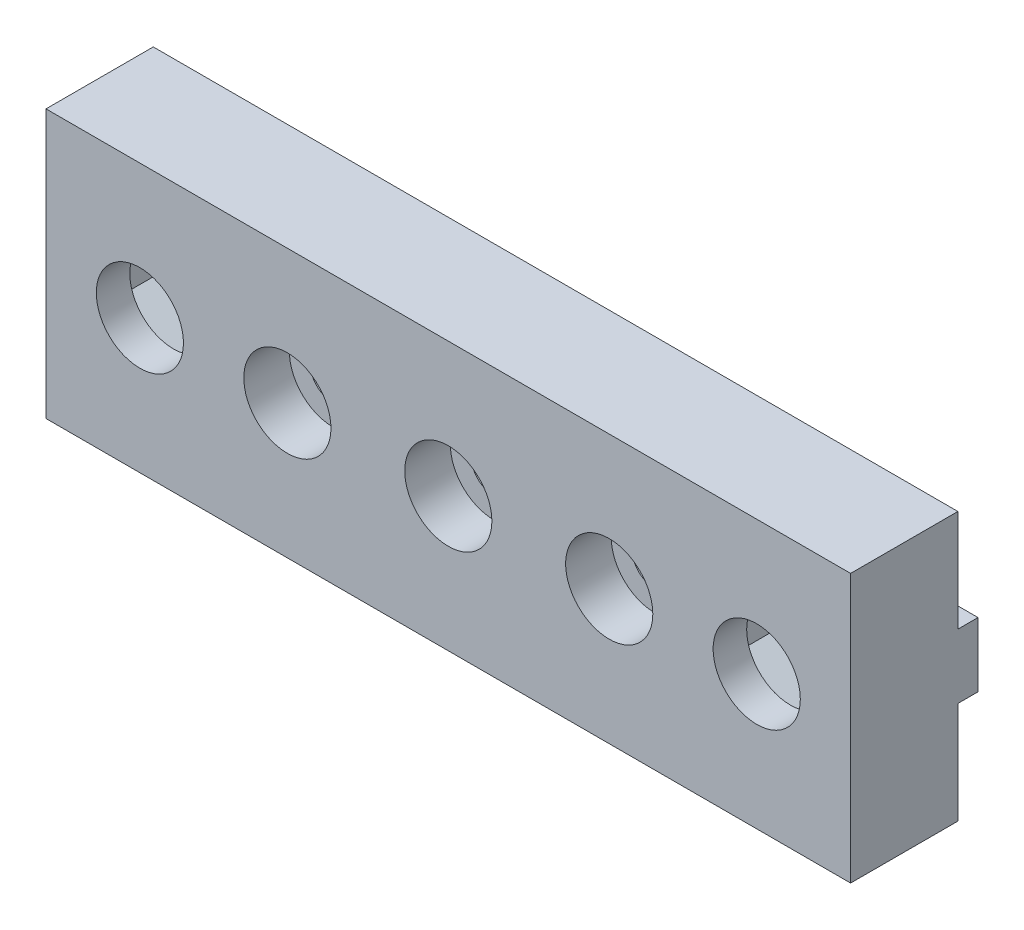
from build123d import *

# Parameters (mm, degrees)
SKIZZE1_W                                            = 60
SKIZZE1_H                                            = 20
AUFSATZ_LINEAR_AUSTRAGEN1_DEPTH                      = 4
SKIZZE4_W                                            = 60
SKIZZE4_H                                            = 4.8
AUFSATZ_LINEAR_AUSTRAGEN2_DEPTH                      = 1.5
F_6_5_6_5_DURCHMESSER_BOHRUNG1_D                     = 6.5
SCHNITT_LINEAR_AUSTRAGEN1_DEPTH                      = 33.619012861
SCHNITT_LINEAR_AUSTRAGEN1_DEPTH_BACK                 = 5.5
STIRNSENKUNG_F_R_M3_ZYLINDERSCHRAUBE_MIT_D           = 3.4
STIRNSENKUNG_F_R_M3_ZYLINDERSCHRAUBE_MIT_CBORE_D     = 6.5
STIRNSENKUNG_F_R_M3_ZYLINDERSCHRAUBE_MIT_CBORE_DEPTH = 3.4


with BuildPart() as part:
    # Skizze1 → Aufsatz-Linear austragen1 (new, symmetric)
    with BuildSketch(Plane.XY):
        Rectangle(SKIZZE1_W, SKIZZE1_H)
    extrude(amount=AUFSATZ_LINEAR_AUSTRAGEN1_DEPTH, both=True)

    # Skizze4 → Aufsatz-Linear austragen2 (add, symmetric)
    with BuildSketch(Plane(origin=(0, 0, -4), x_dir=(-1, 0, 0), z_dir=(0, 0, -1))):
        Rectangle(SKIZZE4_W, SKIZZE4_H)
    extrude(amount=AUFSATZ_LINEAR_AUSTRAGEN2_DEPTH, both=True)

    # 6.5 _6.5_ Durchmesser Bohrung1 (through all)
    with Locations(Plane.XY.offset(4)):
        with Locations((-23, 0), (23, 0)):
            Hole(F_6_5_6_5_DURCHMESSER_BOHRUNG1_D / 2)

    # Skizze5 → Schnitt-Linear austragen1 (cut, two sides: drawn at the far end of the back side and taken through both)
    with BuildSketch(Plane(origin=(0, 0, -4), x_dir=(-1, 0, 0), z_dir=(0, 0, -1)).offset(-SCHNITT_LINEAR_AUSTRAGEN1_DEPTH_BACK)):
        Polygon((-23, 5.888972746), (-28.1, 2.944486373), (-28.1, -2.944486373), (-23, -5.888972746), (-17.9, -2.944486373), (-17.9, 2.944486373), align=None)
        Polygon((23, 5.888972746), (17.9, 2.944486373), (17.9, -2.944486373), (23, -5.888972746), (28.1, -2.944486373), (28.1, 2.944486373), align=None)
    extrude(amount=SCHNITT_LINEAR_AUSTRAGEN1_DEPTH + SCHNITT_LINEAR_AUSTRAGEN1_DEPTH_BACK, mode=Mode.SUBTRACT)

    # Stirnsenkung f_r M3 Zylinderschraube mit (through all)
    with Locations(Plane.XY.offset(4)):
        with Locations((-12, 0), (0, 0), (12, 0)):
            CounterBoreHole(STIRNSENKUNG_F_R_M3_ZYLINDERSCHRAUBE_MIT_D / 2, STIRNSENKUNG_F_R_M3_ZYLINDERSCHRAUBE_MIT_CBORE_D / 2, STIRNSENKUNG_F_R_M3_ZYLINDERSCHRAUBE_MIT_CBORE_DEPTH)


solid = part.part
